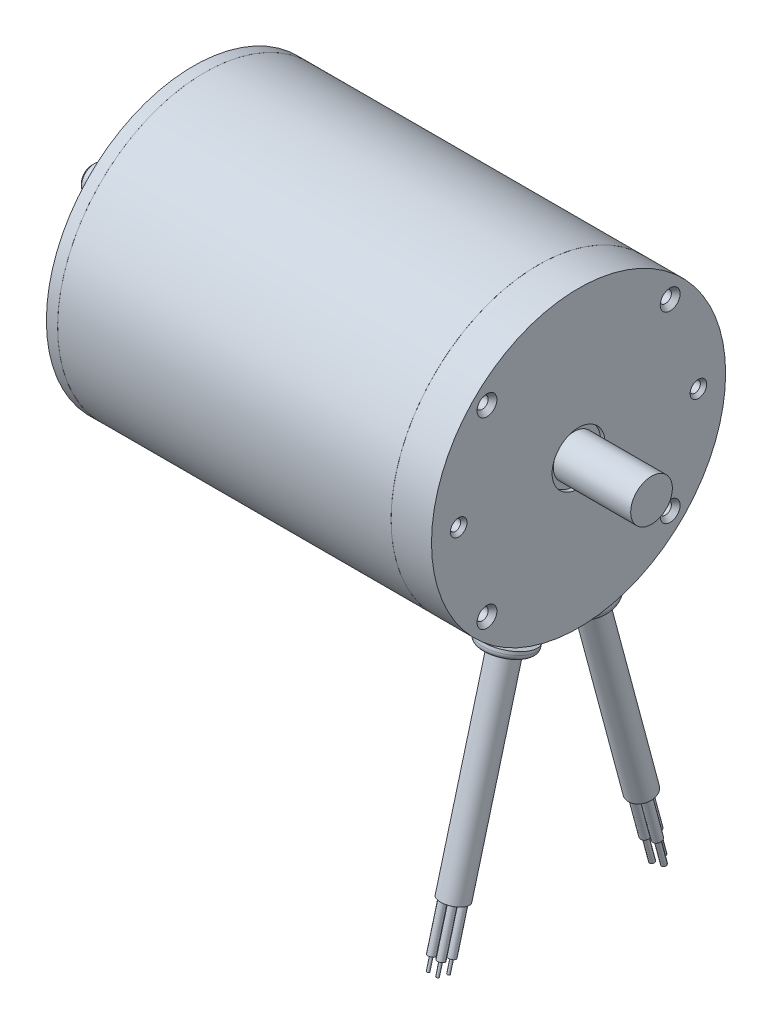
from build123d import *

# Parameters (mm, degrees)
CHAMFER1_SIZE            = 0.508
FILLET1_R                = 0.25
FILLET2_R                = 0.13
CIRPATTERN2_COUNT        = 2
CIRPATTERN3_COUNT        = 4
CIRPATTERN4_COUNT        = 4
SKETCH22_R               = 3.175
CUT_EXTRUDE2_DEPTH       = 0.75
CUT_EXTRUDE3_DEPTH       = 1.75
CIRPATTERN1_COUNT        = 4
SKETCH28_R               = 3.175
BOSS_EXTRUDE3_DEPTH      = 1.5
SKETCH29_R               = 4.7625
BOSS_EXTRUDE4_DEPTH      = 1.588
SKETCH30_R               = 2.54
BOSS_EXTRUDE5_DEPTH      = 38.291
FILLET4_R                = 1
SKETCH31_R               = 2.15
CUT_EXTRUDE4_DEPTH       = 38.291
CIRPATTERN7_COUNT        = 2
CIRPATTERN7_ANGLE        = 330
FILLET4_OF_CIRPATTERN7_R = 1
SKETCH32_R               = 0.889
BOSS_EXTRUDE6_DEPTH      = 47
SKETCH33_R               = 0.6985
BOSS_EXTRUDE7_DEPTH      = 47
SKETCH34_R               = 0.4825
BOSS_EXTRUDE8_DEPTH      = 5.08
SKETCH35_R               = 0.254
BOSS_EXTRUDE9_DEPTH      = 2.54


with BuildPart() as part:
    # Sketch1 → Revolve1 (revolve)
    with BuildSketch(Plane.XY, mode=Mode.PRIVATE) as revolve1_sk:
        Polygon((0, 0), (0, 2.5), (21.12, 2.5), (21.12, 11.006), (20.92, 11.006), (20.92, 9.4), (17.5, 9.4), (17.5, 12.5), (19.5, 12.5), (19.5, 28.22), (93.4, 28.22), (93.4, 5.08), (92.56, 5.08), (92.56, 4), (107.4, 4), (107.4, 0), align=None)
    revolve(revolve1_sk.sketch.rotate(Axis((0, 0, 0), (1, 0, 0)), 90), axis=Axis((0, 0, 0), (1, 0, 0)))

    # Chamfer1
    chamfer1_edges = [part.edges().sort_by_distance(p)[0] for p in [
        (0, 0, -2.5),
    ]]
    chamfer(chamfer1_edges, length=CHAMFER1_SIZE)

    # Fillet1
    fillet1_edges = [part.edges().sort_by_distance(p)[0] for p in [
        (17.5, 0, -12.5),
    ]]
    fillet(fillet1_edges, radius=FILLET1_R)

    # Fillet2
    fillet2_edges = [part.edges().sort_by_distance(p)[0] for p in [
        (17.5, 0, -9.4),
    ]]
    fillet(fillet2_edges, radius=FILLET2_R)

    # Sketch2 → Cut-Revolve1 (revolve, cut)
    with BuildSketch(Plane.XY, mode=Mode.PRIVATE) as cut_revolve1_sk:
        Polygon((85.6465, 28.22), (85.6535, 28.22), (85.65, 28.213937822), align=None)
        Polygon((21.663753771, 28.22), (21.66, 28.213798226), (21.656753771, 28.22), align=None)
    revolve(cut_revolve1_sk.sketch.rotate(Axis((0, 0, 0), (-1, 0, 0)), 90), axis=Axis((0, 0, 0), (-1, 0, 0)), mode=Mode.SUBTRACT)

    # Sketch25 → Cut-Revolve2 (revolve, cut)
    with BuildSketch(Plane.XY, mode=Mode.PRIVATE) as cut_revolve2_sk:
        Polygon((21.12, 6.577215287), (21.12, 5.886771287), (21.446745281, 5.560026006), (21.446745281, 2.737783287), (22.736248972, 2.737783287), (22.736248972, 2.5), (20.92, 2.5), (20.92, 9.364596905), (21.446745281, 9.364596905), (21.446745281, 6.903960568), align=None)
    revolve(cut_revolve2_sk.sketch.rotate(Axis((0, 0, 0), (-1, 0, 0)), 90), axis=Axis((0, 0, 0), (-1, 0, 0)), mode=Mode.SUBTRACT)

    # Sketch11 → 4-40 Tapped Hole2 (revolve, cut)
    with BuildSketch(Plane(origin=(93.4, 17.575139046, 17.575139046), x_dir=(0, 0, -1), z_dir=(0, 1, 0))):
        Polygon((0, 0), (0, 8.274152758), (1.1303, 7.595), (1.1303, 0.891190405), (1.905, 0), align=None)
    f_4_40_tapped_hole2 = revolve(axis=Axis((99.75, 17.575139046, 17.575139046), (-1, 0, 0)), mode=Mode.SUBTRACT)

    # Sketch15 → M2.5x0.45 Tapped Hole2 (revolve, cut)
    with BuildSketch(Plane(origin=(93.4, 0, 23), x_dir=(0, 0, -1), z_dir=(0, 1, 0))):
        Polygon((0, 0), (0, 6.965882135), (1.025, 6.35), (1.025, 0.64995815), (1.59, 0), align=None)
    m2_5x0_45_tapped_hole2 = revolve(axis=Axis((99.75, 0, 23), (-1, 0, 0)), mode=Mode.SUBTRACT)

    # CirPattern2: M2.5x0.45 Tapped Hole2 ×2 about axis
    cirpattern2_axis = Axis((0, 0, 0), (1, 0, 0))
    for i in range(1, CIRPATTERN2_COUNT):
        add(m2_5x0_45_tapped_hole2.rotate(cirpattern2_axis, i * 360 / CIRPATTERN2_COUNT), mode=Mode.SUBTRACT)

    # CirPattern3: 4-40 Tapped Hole2 ×4 about axis
    cirpattern3_axis = Axis((0, 0, 0), (1, 0, 0))
    for i in range(1, CIRPATTERN3_COUNT):
        add(f_4_40_tapped_hole2.rotate(cirpattern3_axis, i * 360 / CIRPATTERN3_COUNT), mode=Mode.SUBTRACT)

    # Sketch18 → M4x0.7 Tapped Hole1 (revolve, cut)
    with BuildSketch(Plane(origin=(19.5, 21, 0), x_dir=(0, 0, 1), z_dir=(0, 1, 0))):
        Polygon((0, 0), (0, 11.091420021), (1.65, 10.1), (1.65, 0.431388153), (2.025, 0), align=None)
    m4x0_7_tapped_hole1 = revolve(axis=Axis((13.15, 21, 0), (1, 0, 0)), mode=Mode.SUBTRACT)

    # CirPattern4: M4x0.7 Tapped Hole1 ×4 about axis
    cirpattern4_axis = Axis((0, 0, 0), (1, 0, 0))
    for i in range(1, CIRPATTERN4_COUNT):
        add(m4x0_7_tapped_hole1.rotate(cirpattern4_axis, i * 360 / CIRPATTERN4_COUNT), mode=Mode.SUBTRACT)

    # Sketch22 → Cut-Extrude2 (cut)
    with BuildSketch(Plane.ZY.offset(-19.5)):
        with Locations((17.575139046, 17.575139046)):
            Circle(SKETCH22_R)
    cut_extrude2 = extrude(amount=-CUT_EXTRUDE2_DEPTH, mode=Mode.SUBTRACT)

    # Sketch23 → Cut-Extrude3 (cut)
    with BuildSketch(Plane.ZY.offset(-20.25)):
        with BuildLine():
            Line((17.064231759, 18.651731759), (16.605413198, 19.11055032))
            ThreePointArc((16.605413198, 19.11055032), (16.291033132, 18.859244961), (16.039727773, 18.544864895))
            Line((16.039727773, 18.544864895), (16.498546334, 18.086046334))
            ThreePointArc((16.498546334, 18.086046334), (16.628532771, 17.908767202), (16.699194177, 17.700605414))
            Line((16.699194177, 17.700605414), (15.987639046, 17.575139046))
            Line((15.987639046, 17.575139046), (16.699194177, 17.449672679))
            ThreePointArc((16.699194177, 17.449672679), (16.628532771, 17.24151089), (16.498546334, 17.064231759))
            Line((16.498546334, 17.064231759), (16.039727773, 16.605413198))
            ThreePointArc((16.039727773, 16.605413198), (16.291033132, 16.291033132), (16.605413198, 16.039727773))
            Line((16.605413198, 16.039727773), (17.064231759, 16.498546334))
            ThreePointArc((17.064231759, 16.498546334), (17.238958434, 16.627197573), (17.444003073, 16.698171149))
            Line((17.444003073, 16.698171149), (17.575139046, 15.987639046))
            Line((17.575139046, 15.987639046), (17.706275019, 16.698171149))
            ThreePointArc((17.706275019, 16.698171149), (17.911319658, 16.627197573), (18.086046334, 16.498546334))
            Line((18.086046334, 16.498546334), (18.544864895, 16.039727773))
            ThreePointArc((18.544864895, 16.039727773), (18.859244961, 16.291033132), (19.11055032, 16.605413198))
            Line((19.11055032, 16.605413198), (18.651731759, 17.064231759))
            ThreePointArc((18.651731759, 17.064231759), (18.521745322, 17.24151089), (18.451083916, 17.449672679))
            Line((18.451083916, 17.449672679), (19.162639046, 17.575139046))
            Line((19.162639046, 17.575139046), (18.451083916, 17.700605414))
            ThreePointArc((18.451083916, 17.700605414), (18.521745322, 17.908767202), (18.651731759, 18.086046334))
            Line((18.651731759, 18.086046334), (19.11055032, 18.544864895))
            ThreePointArc((19.11055032, 18.544864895), (18.859244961, 18.859244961), (18.544864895, 19.11055032))
            Line((18.544864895, 19.11055032), (18.086046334, 18.651731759))
            ThreePointArc((18.086046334, 18.651731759), (17.911319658, 18.52308052), (17.706275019, 18.452106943))
            Line((17.706275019, 18.452106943), (17.575139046, 19.162639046))
            Line((17.575139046, 19.162639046), (17.444003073, 18.452106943))
            ThreePointArc((17.444003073, 18.452106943), (17.238958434, 18.52308052), (17.064231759, 18.651731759))
        make_face()
    cut_extrude3 = extrude(amount=-CUT_EXTRUDE3_DEPTH, mode=Mode.SUBTRACT)

    # CirPattern1: Cut-Extrude2, Cut-Extrude3 ×4 about axis
    cirpattern1_axis = Axis((0, 0, 0), (1, 0, 0))
    add([cut_extrude2.rotate(cirpattern1_axis, i * 360 / CIRPATTERN1_COUNT) for i in range(1, CIRPATTERN1_COUNT)], mode=Mode.SUBTRACT)
    add([cut_extrude3.rotate(cirpattern1_axis, i * 360 / CIRPATTERN1_COUNT) for i in range(1, CIRPATTERN1_COUNT)], mode=Mode.SUBTRACT)

    # Sketch26 → Revolve2 (revolve)
    with BuildSketch(Plane(origin=(0, 0, 0), x_dir=(1, 0, 0), z_dir=(0, 1, 0))):
        Polygon((21.446745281, 2.737783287), (21.12, 3.064528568), (21.12, 3.591970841), (21.446745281, 3.918716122), align=None)
    revolve(axis=Axis((0, 0, 0), (-1, 0, 0)))

    # Sketch28 → Boss-Extrude3 (add, symmetric)
    with BuildSketch(Plane(origin=(0, -27.258426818, 7.303873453), x_dir=(1, 0, 0), z_dir=(0, -0.9659258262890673, 0.25881904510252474))):
        with Locations(Location((87.412551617, 0, 0), (0, 0, 123.644067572))):
            Circle(SKETCH28_R)
    boss_extrude3 = extrude(amount=BOSS_EXTRUDE3_DEPTH, both=True)

    # Sketch29 → Boss-Extrude4 (add)
    with BuildSketch(Plane(origin=(0, -28.707315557, 7.69210202), x_dir=(1, 0, 0), z_dir=(0, -0.9659258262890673, 0.2588190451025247))):
        with Locations(Location((87.412551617, 0, 0), (0, 0, 270))):
            Circle(SKETCH29_R)
    boss_extrude4 = extrude(amount=BOSS_EXTRUDE4_DEPTH)

    # Sketch30 → Boss-Extrude5 (add)
    with BuildSketch(Plane(origin=(0, -30.241205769, 8.103106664), x_dir=(1, 0, 0), z_dir=(0, -0.9659258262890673, 0.25881904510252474))):
        with Locations(Location((87.412551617, 0, 0), (0, 0, 270))):
            Circle(SKETCH30_R)
    boss_extrude5 = extrude(amount=BOSS_EXTRUDE5_DEPTH)

    # Fillet4
    fillet4_edges = [part.edges().sort_by_distance(p)[0] for p in [
        (87.412551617, -29.008580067, 12.703328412),
    ]]
    fillet(fillet4_edges, radius=FILLET4_R)

    # Sketch31 → Cut-Extrude4 (cut)
    with BuildSketch(Plane(origin=(0, -67.227471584, 18.01354672), x_dir=(1, 0, 0), z_dir=(0, -0.9659258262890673, 0.2588190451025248))):
        with Locations(Location((87.412551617, 0, 0), (0, 0, 270))):
            Circle(SKETCH31_R)
    cut_extrude4 = extrude(amount=-CUT_EXTRUDE4_DEPTH, mode=Mode.SUBTRACT)

    # CirPattern7: Boss-Extrude3, Boss-Extrude4, Boss-Extrude5, Cut-Extrude4 ×2 about axis
    cirpattern7_axis = Axis((0, 0, 0), (-1, 0, 0))
    add([boss_extrude3.rotate(cirpattern7_axis, i * CIRPATTERN7_ANGLE / (CIRPATTERN7_COUNT - 1)) for i in range(1, CIRPATTERN7_COUNT)])
    add([boss_extrude4.rotate(cirpattern7_axis, i * CIRPATTERN7_ANGLE / (CIRPATTERN7_COUNT - 1)) for i in range(1, CIRPATTERN7_COUNT)])
    add([boss_extrude5.rotate(cirpattern7_axis, i * CIRPATTERN7_ANGLE / (CIRPATTERN7_COUNT - 1)) for i in range(1, CIRPATTERN7_COUNT)])
    add([cut_extrude4.rotate(cirpattern7_axis, i * CIRPATTERN7_ANGLE / (CIRPATTERN7_COUNT - 1)) for i in range(1, CIRPATTERN7_COUNT)], mode=Mode.SUBTRACT)

    # Fillet4 of CirPattern7
    fillet4_of_cirpattern7_edges = [part.edges().sort_by_distance(p)[0] for p in [
        (87.412551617, -31.473831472, -3.502884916),
    ]]
    fillet(fillet4_of_cirpattern7_edges, radius=FILLET4_OF_CIRPATTERN7_R)

    # Sketch32 → Boss-Extrude6 (add)
    with BuildSketch(Plane(origin=(0, -30.241205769, -8.103106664), x_dir=(1, 0, 0), z_dir=(0, -0.9659258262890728, -0.2588190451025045))):
        with Locations(Location((86.676490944, 0.779203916, 0), (0, 0, 270))):
            Circle(SKETCH32_R)
        with Locations(Location((87.105771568, -1.027049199, 0), (0, 0, 270))):
            Circle(SKETCH32_R)
        with Locations(Location((88.455392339, 0.247845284, 0), (0, 0, 270))):
            Circle(SKETCH32_R)
    extrude(amount=BOSS_EXTRUDE6_DEPTH)

    # Sketch33 → Boss-Extrude7 (add)
    with BuildSketch(Plane(origin=(0, -30.241205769, 8.103106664), x_dir=(1, 0, 0), z_dir=(0, -0.9659258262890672, 0.25881904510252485))):
        with Locations(Location((87.412551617, 0, 0), (0, 0, 270))):
            Circle(SKETCH33_R)
        with Locations(Location((86.504246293, 1.091960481, 0), (0, 0, 270))):
            Circle(SKETCH33_R)
        with Locations(Location((88.315786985, 1.091960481, 0), (0, 0, 270))):
            Circle(SKETCH33_R)
        with Locations(Location((88.315786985, -1.088724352, 0), (0, 0, 270))):
            Circle(SKETCH33_R)
        with Locations(Location((86.504246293, -1.088724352, 0), (0, 0, 270))):
            Circle(SKETCH33_R)
    extrude(amount=BOSS_EXTRUDE7_DEPTH)

    # Sketch34 → Boss-Extrude8 (add)
    with BuildSketch(Plane(origin=(0, -75.639719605, -20.267601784), x_dir=(1, 0, 0), z_dir=(0, -0.9659258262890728, -0.25881904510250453))):
        with Locations(Location((88.455392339, 0.247845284, 0), (0, 0, 270))):
            Circle(SKETCH34_R)
        with Locations(Location((86.676490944, 0.779203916, 0), (0, 0, 270))):
            Circle(SKETCH34_R)
        with Locations(Location((87.105771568, -1.027049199, 0), (0, 0, 270))):
            Circle(SKETCH34_R)
    extrude(amount=BOSS_EXTRUDE8_DEPTH)

    # Sketch35 → Boss-Extrude9 (add)
    with BuildSketch(Plane(origin=(0, -75.639719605, 20.267601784), x_dir=(1, 0, 0), z_dir=(0, -0.9659258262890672, 0.25881904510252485))):
        with Locations(Location((88.315786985, -1.088724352, 0), (0, 0, 270))):
            Circle(SKETCH35_R)
        with Locations(Location((86.504246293, -1.088724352, 0), (0, 0, 270))):
            Circle(SKETCH35_R)
        with Locations(Location((87.412551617, 0, 0), (0, 0, 270))):
            Circle(SKETCH35_R)
        with Locations(Location((86.504246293, 1.091960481, 0), (0, 0, 270))):
            Circle(SKETCH35_R)
        with Locations(Location((88.315786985, 1.091960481, 0), (0, 0, 270))):
            Circle(SKETCH35_R)
    extrude(amount=BOSS_EXTRUDE9_DEPTH)


solid = part.part
